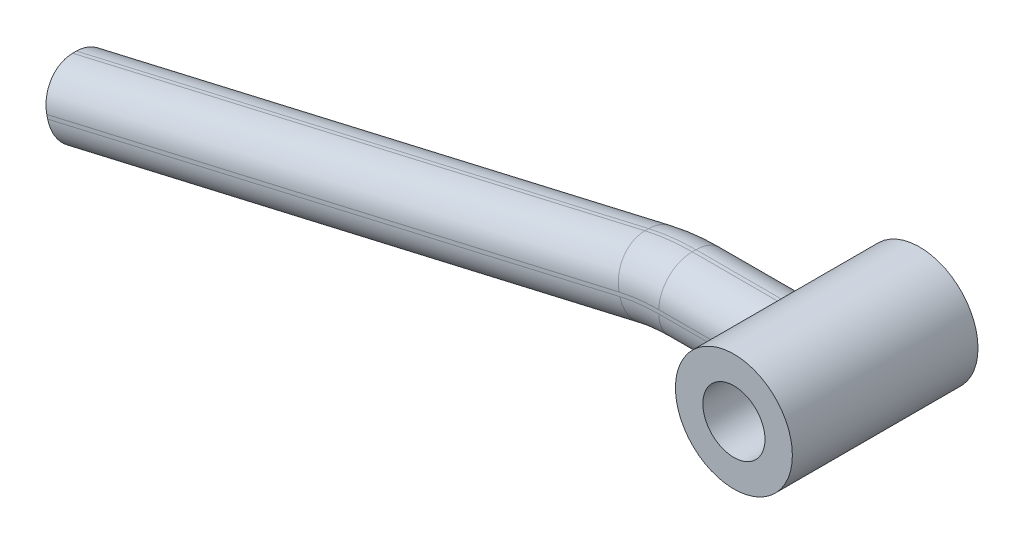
ISO-10303-21;
HEADER;
FILE_DESCRIPTION(('STEP AP214'),'2;1');
FILE_NAME('part.step','',(''),(''),'','','');
FILE_SCHEMA(('AUTOMOTIVE_DESIGN { 1 0 10303 214 1 1 1 1 }'));
ENDSEC;
DATA;
#1=APPLICATION_CONTEXT('core data for automotive mechanical design processes');
#2=APPLICATION_PROTOCOL_DEFINITION('international standard','automotive_design',2000,#1);
#3=PRODUCT_CONTEXT('',#1,'mechanical');
#4=PRODUCT('Part','Part','',(#3));
#5=PRODUCT_RELATED_PRODUCT_CATEGORY('part','',(#4));
#6=PRODUCT_DEFINITION_FORMATION('','',#4);
#7=PRODUCT_DEFINITION_CONTEXT('part definition',#1,'design');
#8=PRODUCT_DEFINITION('design','',#6,#7);
#9=PRODUCT_DEFINITION_SHAPE('','',#8);
#10=(LENGTH_UNIT() NAMED_UNIT(*) SI_UNIT(.MILLI.,.METRE.));
#11=(NAMED_UNIT(*) PLANE_ANGLE_UNIT() SI_UNIT($,.RADIAN.));
#12=(NAMED_UNIT(*) SI_UNIT($,.STERADIAN.) SOLID_ANGLE_UNIT());
#13=UNCERTAINTY_MEASURE_WITH_UNIT(LENGTH_MEASURE(1.E-05),#10,'distance_accuracy_value','');
#14=(GEOMETRIC_REPRESENTATION_CONTEXT(3) GLOBAL_UNCERTAINTY_ASSIGNED_CONTEXT((#13)) GLOBAL_UNIT_ASSIGNED_CONTEXT((#10,
#11,#12)) REPRESENTATION_CONTEXT('',''));
#15=CARTESIAN_POINT('',(0.,0.,0.));
#16=DIRECTION('',(0.,0.,1.));
#17=DIRECTION('',(1.,0.,0.));
#18=AXIS2_PLACEMENT_3D('',#15,#16,#17);
#19=CARTESIAN_POINT('',(0.,0.,6.35));
#20=DIRECTION('',(0.,0.,-1.));
#21=DIRECTION('',(-1.,0.,0.));
#22=AXIS2_PLACEMENT_3D('',#19,#20,#21);
#23=CYLINDRICAL_SURFACE('',#22,4.0005);
#24=DIRECTION('',(0.,0.,-1.));
#25=VECTOR('',#24,1.);
#26=CARTESIAN_POINT('',(-3.19083550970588,2.413,6.35));
#27=LINE('',#26,#25);
#28=CARTESIAN_POINT('',(-3.19083550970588,2.413,0.127));
#29=VERTEX_POINT('',#28);
#30=CARTESIAN_POINT('',(-3.19083550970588,2.413,-0.127));
#31=VERTEX_POINT('',#30);
#32=EDGE_CURVE('E296',#29,#31,#27,.T.);
#33=ORIENTED_EDGE('',*,*,#32,.F.);
#34=CARTESIAN_POINT('',(-3.19083550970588,2.413,0.127));
#35=CARTESIAN_POINT('',(-3.19081169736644,2.41301290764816,0.184622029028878));
#36=CARTESIAN_POINT('',(-3.19248244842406,2.41082185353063,0.242229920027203));
#37=CARTESIAN_POINT('',(-3.19903175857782,2.40213431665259,0.356882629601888));
#38=CARTESIAN_POINT('',(-3.20390722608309,2.39564198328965,0.413927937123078));
#39=CARTESIAN_POINT('',(-3.21663369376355,2.37852343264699,0.52657680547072));
#40=CARTESIAN_POINT('',(-3.22446034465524,2.36793102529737,0.582188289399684));
#41=CARTESIAN_POINT('',(-3.24277881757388,2.3427821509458,0.692052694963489));
#42=CARTESIAN_POINT('',(-3.25327116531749,2.32822490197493,0.746305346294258));
#43=CARTESIAN_POINT('',(-3.28812294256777,2.27900507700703,0.906132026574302));
#44=CARTESIAN_POINT('',(-3.31591982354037,2.23871513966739,1.00928105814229));
#45=CARTESIAN_POINT('',(-3.37755864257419,2.14458806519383,1.20738021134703));
#46=CARTESIAN_POINT('',(-3.41141424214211,2.09072019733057,1.30231106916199));
#47=CARTESIAN_POINT('',(-3.48639881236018,1.96344375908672,1.49375654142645));
#48=CARTESIAN_POINT('',(-3.5279122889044,1.88846020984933,1.58907542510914));
#49=CARTESIAN_POINT('',(-3.61094457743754,1.72439512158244,1.76674256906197));
#50=CARTESIAN_POINT('',(-3.65246338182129,1.63530659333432,1.84908435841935));
#51=CARTESIAN_POINT('',(-3.73690768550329,1.43281155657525,2.00826604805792));
#52=CARTESIAN_POINT('',(-3.77940820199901,1.31777119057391,2.08327206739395));
#53=CARTESIAN_POINT('',(-3.85577043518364,1.07389111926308,2.21221085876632));
#54=CARTESIAN_POINT('',(-3.88964984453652,0.945080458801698,2.26618691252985));
#55=CARTESIAN_POINT('',(-3.92864557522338,0.756887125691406,2.32525459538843));
#56=CARTESIAN_POINT('',(-3.93891512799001,0.701553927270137,2.34036781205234));
#57=CARTESIAN_POINT('',(-3.95722612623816,0.589551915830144,2.36645101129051));
#58=CARTESIAN_POINT('',(-3.96526811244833,0.532883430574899,2.37742199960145));
#59=CARTESIAN_POINT('',(-3.97898979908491,0.418309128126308,2.39510725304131));
#60=CARTESIAN_POINT('',(-3.98465743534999,0.360398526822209,2.40179986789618));
#61=CARTESIAN_POINT('',(-3.9934809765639,0.244009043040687,2.41075237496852));
#62=CARTESIAN_POINT('',(-3.99663525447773,0.185529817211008,2.41300939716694));
#63=CARTESIAN_POINT('',(-3.99848361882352,0.126999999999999,2.413));
#64=B_SPLINE_CURVE_WITH_KNOTS('',3,(#34,#35,#36,#37,#38,#39,#40,#41,#42,#43,#44,#45,#46,#47,#48,
#49,#50,#51,#52,#53,#54,#55,#56,#57,#58,#59,#60,#61,#62,#63),.UNSPECIFIED.,.F.,.F.,(4,2,2,2,2,2,
2,2,2,2,2,2,2,2,4),(0.,0.172777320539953,0.345388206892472,0.516605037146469,0.687855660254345,
1.02882778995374,1.37057867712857,1.75364117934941,2.13689409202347,2.56595400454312,
2.99412614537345,3.16878253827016,3.34339649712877,3.51888722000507,3.6944914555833),.UNSPECIFIED.);
#65=CARTESIAN_POINT('',(-3.99848361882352,0.126999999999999,2.413));
#66=VERTEX_POINT('',#65);
#67=EDGE_CURVE('E11',#29,#66,#64,.T.);
#68=ORIENTED_EDGE('',*,*,#67,.T.);
#69=CARTESIAN_POINT('',(0.,0.,2.413));
#70=DIRECTION('',(0.,0.,1.));
#71=DIRECTION('',(1.,0.,0.));
#72=AXIS2_PLACEMENT_3D('',#69,#70,#71);
#73=CIRCLE('',#72,4.0005);
#74=CARTESIAN_POINT('',(-3.99848361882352,-0.127000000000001,2.413));
#75=VERTEX_POINT('',#74);
#76=EDGE_CURVE('E161',#66,#75,#73,.T.);
#77=ORIENTED_EDGE('',*,*,#76,.T.);
#78=CARTESIAN_POINT('',(-3.99848361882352,-0.127000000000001,2.413));
#79=CARTESIAN_POINT('',(-3.99659606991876,-0.186799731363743,2.4130104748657));
#80=CARTESIAN_POINT('',(-3.99334406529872,-0.24654662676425,2.41065390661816));
#81=CARTESIAN_POINT('',(-3.98421628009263,-0.365443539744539,2.40130913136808));
#82=CARTESIAN_POINT('',(-3.97834192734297,-0.424593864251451,2.39432344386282));
#83=CARTESIAN_POINT('',(-3.96411161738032,-0.541549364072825,2.3758736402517));
#84=CARTESIAN_POINT('',(-3.95576951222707,-0.599360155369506,2.36443441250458));
#85=CARTESIAN_POINT('',(-3.9367739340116,-0.713559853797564,2.3372472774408));
#86=CARTESIAN_POINT('',(-3.926120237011,-0.769948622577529,2.32149895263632));
#87=CARTESIAN_POINT('',(-3.89104772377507,-0.936225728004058,2.26813410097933));
#88=CARTESIAN_POINT('',(-3.86347718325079,-1.04354240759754,2.22434630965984));
#89=CARTESIAN_POINT('',(-3.80205621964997,-1.24896686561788,2.12204468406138));
#90=CARTESIAN_POINT('',(-3.76819831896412,-1.34706346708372,2.06351328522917));
#91=CARTESIAN_POINT('',(-3.69377426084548,-1.53998120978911,1.92817862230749));
#92=CARTESIAN_POINT('',(-3.6528884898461,-1.63391768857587,1.85029065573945));
#93=CARTESIAN_POINT('',(-3.56988230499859,-1.80811413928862,1.68084790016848));
#94=CARTESIAN_POINT('',(-3.5277602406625,-1.88835475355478,1.58927410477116));
#95=CARTESIAN_POINT('',(-3.44138645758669,-2.04192246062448,1.38287963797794));
#96=CARTESIAN_POINT('',(-3.39742383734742,-2.1134712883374,1.26660430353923));
#97=CARTESIAN_POINT('',(-3.318465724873,-2.2354168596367,1.02088431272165));
#98=CARTESIAN_POINT('',(-3.28343831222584,-2.28588932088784,0.891488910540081));
#99=CARTESIAN_POINT('',(-3.24563345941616,-2.3388398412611,0.706931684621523));
#100=CARTESIAN_POINT('',(-3.23637857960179,-2.35160355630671,0.655890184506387));
#101=CARTESIAN_POINT('',(-3.22025595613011,-2.37363416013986,0.552686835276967));
#102=CARTESIAN_POINT('',(-3.21338741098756,-2.38290222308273,0.50052536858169));
#103=CARTESIAN_POINT('',(-3.20224302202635,-2.39785997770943,0.395041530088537));
#104=CARTESIAN_POINT('',(-3.1979855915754,-2.40352426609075,0.341713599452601));
#105=CARTESIAN_POINT('',(-3.19227150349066,-2.41110087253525,0.234594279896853));
#106=CARTESIAN_POINT('',(-3.19081745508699,-2.41300969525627,0.180802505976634));
#107=CARTESIAN_POINT('',(-3.19083550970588,-2.413,0.127));
#108=B_SPLINE_CURVE_WITH_KNOTS('',3,(#78,#79,#80,#81,#82,#83,#84,#85,#86,#87,#88,#89,#90,#91,
#92,#93,#94,#95,#96,#97,#98,#99,#100,#101,#102,#103,#104,#105,#106,#107),.UNSPECIFIED.,.F.,.F.,
(4,2,2,2,2,2,2,2,2,2,2,2,2,2,4),(0.,0.179411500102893,0.358725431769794,0.537051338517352,
0.715394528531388,1.07112063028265,1.42727254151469,1.8118189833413,2.19690451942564,
2.62507958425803,3.05170289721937,3.21182695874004,3.37189718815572,3.53308361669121,
3.69441999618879),.UNSPECIFIED.);
#109=CARTESIAN_POINT('',(-3.19083550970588,-2.413,0.127));
#110=VERTEX_POINT('',#109);
#111=EDGE_CURVE('E222',#75,#110,#108,.T.);
#112=ORIENTED_EDGE('',*,*,#111,.T.);
#113=DIRECTION('',(0.,0.,-1.));
#114=VECTOR('',#113,1.);
#115=CARTESIAN_POINT('',(-3.19083550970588,-2.413,6.35));
#116=LINE('',#115,#114);
#117=CARTESIAN_POINT('',(-3.19083550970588,-2.413,-0.127));
#118=VERTEX_POINT('',#117);
#119=EDGE_CURVE('E287',#118,#110,#116,.F.);
#120=ORIENTED_EDGE('',*,*,#119,.F.);
#121=CARTESIAN_POINT('',(-3.19083550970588,-2.413,-0.127));
#122=CARTESIAN_POINT('',(-3.19081169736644,-2.41301290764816,-0.184622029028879));
#123=CARTESIAN_POINT('',(-3.19248244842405,-2.41082185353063,-0.242229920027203));
#124=CARTESIAN_POINT('',(-3.19903175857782,-2.40213431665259,-0.356882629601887));
#125=CARTESIAN_POINT('',(-3.20390722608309,-2.39564198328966,-0.413927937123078));
#126=CARTESIAN_POINT('',(-3.21663369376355,-2.37852343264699,-0.52657680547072));
#127=CARTESIAN_POINT('',(-3.22446034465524,-2.36793102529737,-0.582188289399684));
#128=CARTESIAN_POINT('',(-3.24277881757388,-2.3427821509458,-0.692052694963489));
#129=CARTESIAN_POINT('',(-3.25327116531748,-2.32822490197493,-0.746305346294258));
#130=CARTESIAN_POINT('',(-3.28812294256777,-2.27900507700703,-0.906132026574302));
#131=CARTESIAN_POINT('',(-3.31591982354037,-2.23871513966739,-1.00928105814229));
#132=CARTESIAN_POINT('',(-3.37755864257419,-2.14458806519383,-1.20738021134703));
#133=CARTESIAN_POINT('',(-3.41141424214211,-2.09072019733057,-1.30231106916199));
#134=CARTESIAN_POINT('',(-3.48639881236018,-1.96344375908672,-1.49375654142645));
#135=CARTESIAN_POINT('',(-3.5279122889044,-1.88846020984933,-1.58907542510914));
#136=CARTESIAN_POINT('',(-3.61094457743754,-1.72439512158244,-1.76674256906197));
#137=CARTESIAN_POINT('',(-3.65246338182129,-1.63530659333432,-1.84908435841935));
#138=CARTESIAN_POINT('',(-3.73690768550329,-1.43281155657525,-2.00826604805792));
#139=CARTESIAN_POINT('',(-3.77940820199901,-1.31777119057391,-2.08327206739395));
#140=CARTESIAN_POINT('',(-3.85577043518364,-1.07389111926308,-2.21221085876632));
#141=CARTESIAN_POINT('',(-3.88964984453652,-0.945080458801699,-2.26618691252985));
#142=CARTESIAN_POINT('',(-3.92864557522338,-0.756887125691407,-2.32525459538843));
#143=CARTESIAN_POINT('',(-3.93891512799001,-0.701553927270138,-2.34036781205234));
#144=CARTESIAN_POINT('',(-3.95722612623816,-0.589551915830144,-2.36645101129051));
#145=CARTESIAN_POINT('',(-3.96526811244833,-0.5328834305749,-2.37742199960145));
#146=CARTESIAN_POINT('',(-3.9789897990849,-0.418309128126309,-2.39510725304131));
#147=CARTESIAN_POINT('',(-3.98465743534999,-0.36039852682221,-2.40179986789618));
#148=CARTESIAN_POINT('',(-3.9934809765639,-0.244009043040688,-2.41075237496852));
#149=CARTESIAN_POINT('',(-3.99663525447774,-0.185529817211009,-2.41300939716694));
#150=CARTESIAN_POINT('',(-3.99848361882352,-0.127,-2.413));
#151=B_SPLINE_CURVE_WITH_KNOTS('',3,(#121,#122,#123,#124,#125,#126,#127,#128,#129,#130,#131,
#132,#133,#134,#135,#136,#137,#138,#139,#140,#141,#142,#143,#144,#145,#146,#147,#148,#149,#150),
.UNSPECIFIED.,.F.,.F.,(4,2,2,2,2,2,2,2,2,2,2,2,2,2,4),(0.,0.172777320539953,0.345388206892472,
0.516605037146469,0.687855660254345,1.02882778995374,1.37057867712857,1.75364117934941,
2.13689409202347,2.56595400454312,2.99412614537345,3.16878253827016,3.34339649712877,
3.51888722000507,3.6944914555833),.UNSPECIFIED.);
#152=CARTESIAN_POINT('',(-3.99848361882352,-0.127000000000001,-2.413));
#153=VERTEX_POINT('',#152);
#154=EDGE_CURVE('E216',#118,#153,#151,.T.);
#155=ORIENTED_EDGE('',*,*,#154,.T.);
#156=CARTESIAN_POINT('',(0.,0.,-2.413));
#157=DIRECTION('',(0.,0.,1.));
#158=DIRECTION('',(1.,0.,0.));
#159=AXIS2_PLACEMENT_3D('',#156,#157,#158);
#160=CIRCLE('',#159,4.0005);
#161=CARTESIAN_POINT('',(-3.99848361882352,0.126999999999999,-2.413));
#162=VERTEX_POINT('',#161);
#163=EDGE_CURVE('E283',#162,#153,#160,.T.);
#164=ORIENTED_EDGE('',*,*,#163,.F.);
#165=CARTESIAN_POINT('',(-3.99848361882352,0.126999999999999,-2.413));
#166=CARTESIAN_POINT('',(-3.99659606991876,0.186799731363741,-2.4130104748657));
#167=CARTESIAN_POINT('',(-3.99334406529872,0.246546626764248,-2.41065390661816));
#168=CARTESIAN_POINT('',(-3.98421628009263,0.365443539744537,-2.40130913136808));
#169=CARTESIAN_POINT('',(-3.97834192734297,0.424593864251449,-2.39432344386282));
#170=CARTESIAN_POINT('',(-3.96411161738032,0.541549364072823,-2.3758736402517));
#171=CARTESIAN_POINT('',(-3.95576951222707,0.599360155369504,-2.36443441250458));
#172=CARTESIAN_POINT('',(-3.9367739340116,0.713559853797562,-2.3372472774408));
#173=CARTESIAN_POINT('',(-3.926120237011,0.769948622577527,-2.32149895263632));
#174=CARTESIAN_POINT('',(-3.89104772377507,0.936225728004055,-2.26813410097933));
#175=CARTESIAN_POINT('',(-3.86347718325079,1.04354240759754,-2.22434630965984));
#176=CARTESIAN_POINT('',(-3.80205621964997,1.24896686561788,-2.12204468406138));
#177=CARTESIAN_POINT('',(-3.76819831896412,1.34706346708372,-2.06351328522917));
#178=CARTESIAN_POINT('',(-3.69377426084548,1.53998120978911,-1.92817862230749));
#179=CARTESIAN_POINT('',(-3.6528884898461,1.63391768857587,-1.85029065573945));
#180=CARTESIAN_POINT('',(-3.56988230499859,1.80811413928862,-1.68084790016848));
#181=CARTESIAN_POINT('',(-3.5277602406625,1.88835475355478,-1.58927410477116));
#182=CARTESIAN_POINT('',(-3.4413864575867,2.04192246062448,-1.38287963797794));
#183=CARTESIAN_POINT('',(-3.39742383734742,2.11347128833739,-1.26660430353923));
#184=CARTESIAN_POINT('',(-3.318465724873,2.2354168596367,-1.02088431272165));
#185=CARTESIAN_POINT('',(-3.28343831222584,2.28588932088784,-0.891488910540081));
#186=CARTESIAN_POINT('',(-3.24563345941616,2.33883984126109,-0.706931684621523));
#187=CARTESIAN_POINT('',(-3.23637857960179,2.35160355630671,-0.655890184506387));
#188=CARTESIAN_POINT('',(-3.22025595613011,2.37363416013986,-0.552686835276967));
#189=CARTESIAN_POINT('',(-3.21338741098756,2.38290222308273,-0.50052536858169));
#190=CARTESIAN_POINT('',(-3.20224302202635,2.39785997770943,-0.395041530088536));
#191=CARTESIAN_POINT('',(-3.1979855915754,2.40352426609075,-0.3417135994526));
#192=CARTESIAN_POINT('',(-3.19227150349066,2.41110087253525,-0.234594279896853));
#193=CARTESIAN_POINT('',(-3.190817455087,2.41300969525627,-0.180802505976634));
#194=CARTESIAN_POINT('',(-3.19083550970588,2.413,-0.127));
#195=B_SPLINE_CURVE_WITH_KNOTS('',3,(#165,#166,#167,#168,#169,#170,#171,#172,#173,#174,#175,
#176,#177,#178,#179,#180,#181,#182,#183,#184,#185,#186,#187,#188,#189,#190,#191,#192,#193,#194),
.UNSPECIFIED.,.F.,.F.,(4,2,2,2,2,2,2,2,2,2,2,2,2,2,4),(0.,0.179411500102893,0.358725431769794,
0.537051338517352,0.715394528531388,1.07112063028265,1.42727254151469,1.8118189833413,
2.19690451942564,2.62507958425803,3.05170289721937,3.21182695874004,3.37189718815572,
3.53308361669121,3.69441999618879),.UNSPECIFIED.);
#196=EDGE_CURVE('E42',#162,#31,#195,.T.);
#197=ORIENTED_EDGE('',*,*,#196,.T.);
#198=EDGE_LOOP('',(#33,#68,#77,#112,#120,#155,#164,#197));
#199=FACE_BOUND('',#198,.T.);
#200=CARTESIAN_POINT('',(0.,0.,6.35));
#201=DIRECTION('',(0.,0.,1.));
#202=DIRECTION('',(1.,0.,0.));
#203=AXIS2_PLACEMENT_3D('',#200,#201,#202);
#204=CIRCLE('',#203,4.0005);
#205=CARTESIAN_POINT('',(4.0005,0.,6.35));
#206=VERTEX_POINT('',#205);
#207=EDGE_CURVE('E281',#206,#206,#204,.T.);
#208=ORIENTED_EDGE('',*,*,#207,.F.);
#209=EDGE_LOOP('',(#208));
#210=FACE_BOUND('',#209,.T.);
#211=CARTESIAN_POINT('',(0.,0.,-6.35));
#212=DIRECTION('',(0.,0.,1.));
#213=DIRECTION('',(1.,0.,0.));
#214=AXIS2_PLACEMENT_3D('',#211,#212,#213);
#215=CIRCLE('',#214,4.0005);
#216=CARTESIAN_POINT('',(4.0005,0.,-6.35));
#217=VERTEX_POINT('',#216);
#218=EDGE_CURVE('E284',#217,#217,#215,.T.);
#219=ORIENTED_EDGE('',*,*,#218,.T.);
#220=EDGE_LOOP('',(#219));
#221=FACE_BOUND('',#220,.T.);
#222=ADVANCED_FACE('F30',(#199,#210,#221),#23,.T.);
#223=CARTESIAN_POINT('',(0.,0.,6.35));
#224=DIRECTION('',(0.,0.,1.));
#225=DIRECTION('',(1.,0.,0.));
#226=AXIS2_PLACEMENT_3D('',#223,#224,#225);
#227=PLANE('',#226);
#228=CARTESIAN_POINT('',(0.,0.,6.35));
#229=DIRECTION('',(0.,0.,1.));
#230=DIRECTION('',(1.,0.,0.));
#231=AXIS2_PLACEMENT_3D('',#228,#229,#230);
#232=CIRCLE('',#231,2.12601242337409);
#233=CARTESIAN_POINT('',(2.12601242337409,0.,6.35));
#234=VERTEX_POINT('',#233);
#235=EDGE_CURVE('E278',#234,#234,#232,.T.);
#236=ORIENTED_EDGE('',*,*,#235,.F.);
#237=EDGE_LOOP('',(#236));
#238=FACE_BOUND('',#237,.T.);
#239=ORIENTED_EDGE('',*,*,#207,.T.);
#240=EDGE_LOOP('',(#239));
#241=FACE_BOUND('',#240,.T.);
#242=ADVANCED_FACE('F268',(#238,#241),#227,.T.);
#243=CARTESIAN_POINT('',(0.,0.,-6.35));
#244=DIRECTION('',(0.,0.,1.));
#245=DIRECTION('',(1.,0.,0.));
#246=AXIS2_PLACEMENT_3D('',#243,#244,#245);
#247=PLANE('',#246);
#248=CARTESIAN_POINT('',(0.,0.,-6.35));
#249=DIRECTION('',(0.,0.,1.));
#250=DIRECTION('',(1.,0.,0.));
#251=AXIS2_PLACEMENT_3D('',#248,#249,#250);
#252=CIRCLE('',#251,2.12601242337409);
#253=CARTESIAN_POINT('',(2.12601242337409,0.,-6.35));
#254=VERTEX_POINT('',#253);
#255=EDGE_CURVE('E415',#254,#254,#252,.T.);
#256=ORIENTED_EDGE('',*,*,#255,.T.);
#257=EDGE_LOOP('',(#256));
#258=FACE_BOUND('',#257,.T.);
#259=ORIENTED_EDGE('',*,*,#218,.F.);
#260=EDGE_LOOP('',(#259));
#261=FACE_BOUND('',#260,.T.);
#262=ADVANCED_FACE('F266',(#258,#261),#247,.F.);
#263=CARTESIAN_POINT('',(0.,2.413,2.413));
#264=DIRECTION('',(0.,-1.,0.));
#265=DIRECTION('',(1.,0.,0.));
#266=AXIS2_PLACEMENT_3D('',#263,#264,#265);
#267=PLANE('',#266);
#268=ORIENTED_EDGE('',*,*,#32,.T.);
#269=DIRECTION('',(-1.,0.,0.));
#270=VECTOR('',#269,1.);
#271=CARTESIAN_POINT('',(0.,2.413,-0.127));
#272=LINE('',#271,#270);
#273=CARTESIAN_POINT('',(-9.07272461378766,2.413,-0.127));
#274=VERTEX_POINT('',#273);
#275=EDGE_CURVE('E214',#31,#274,#272,.T.);
#276=ORIENTED_EDGE('',*,*,#275,.T.);
#277=DIRECTION('',(0.,0.,-1.));
#278=VECTOR('',#277,1.);
#279=CARTESIAN_POINT('',(-9.07272461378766,2.413,2.413));
#280=LINE('',#279,#278);
#281=CARTESIAN_POINT('',(-9.07272461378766,2.413,0.127));
#282=VERTEX_POINT('',#281);
#283=EDGE_CURVE('E290',#282,#274,#280,.T.);
#284=ORIENTED_EDGE('',*,*,#283,.F.);
#285=DIRECTION('',(-1.,0.,0.));
#286=VECTOR('',#285,1.);
#287=CARTESIAN_POINT('',(-3.19083550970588,2.413,0.127));
#288=LINE('',#287,#286);
#289=EDGE_CURVE('E55',#282,#29,#288,.F.);
#290=ORIENTED_EDGE('',*,*,#289,.T.);
#291=EDGE_LOOP('',(#268,#276,#284,#290));
#292=FACE_BOUND('',#291,.T.);
#293=ADVANCED_FACE('F248',(#292),#267,.F.);
#294=CARTESIAN_POINT('',(0.,-2.413,2.413));
#295=DIRECTION('',(0.,1.,0.));
#296=DIRECTION('',(-1.,0.,0.));
#297=AXIS2_PLACEMENT_3D('',#294,#295,#296);
#298=PLANE('',#297);
#299=DIRECTION('',(0.,0.,-1.));
#300=VECTOR('',#299,1.);
#301=CARTESIAN_POINT('',(-9.07272461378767,-2.413,2.413));
#302=LINE('',#301,#300);
#303=CARTESIAN_POINT('',(-9.07272461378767,-2.413,0.127));
#304=VERTEX_POINT('',#303);
#305=CARTESIAN_POINT('',(-9.07272461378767,-2.413,-0.127));
#306=VERTEX_POINT('',#305);
#307=EDGE_CURVE('E386',#304,#306,#302,.T.);
#308=ORIENTED_EDGE('',*,*,#307,.T.);
#309=DIRECTION('',(1.,0.,0.));
#310=VECTOR('',#309,1.);
#311=CARTESIAN_POINT('',(0.,-2.413,-0.127));
#312=LINE('',#311,#310);
#313=EDGE_CURVE('E189',#306,#118,#312,.T.);
#314=ORIENTED_EDGE('',*,*,#313,.T.);
#315=ORIENTED_EDGE('',*,*,#119,.T.);
#316=DIRECTION('',(1.,0.,0.));
#317=VECTOR('',#316,1.);
#318=CARTESIAN_POINT('',(-9.07272461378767,-2.413,0.127));
#319=LINE('',#318,#317);
#320=EDGE_CURVE('E187',#110,#304,#319,.F.);
#321=ORIENTED_EDGE('',*,*,#320,.T.);
#322=EDGE_LOOP('',(#308,#314,#315,#321));
#323=FACE_BOUND('',#322,.T.);
#324=ADVANCED_FACE('F244',(#323),#298,.F.);
#325=CARTESIAN_POINT('',(-9.07272461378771,-11.938,2.413));
#326=DIRECTION('',(0.,0.,1.));
#327=DIRECTION('',(1.,0.,0.));
#328=AXIS2_PLACEMENT_3D('',#325,#326,#327);
#329=PLANE('',#328);
#330=CARTESIAN_POINT('',(-9.07272461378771,-11.938,2.413));
#331=DIRECTION('',(0.,0.,1.));
#332=DIRECTION('',(1.,0.,0.));
#333=AXIS2_PLACEMENT_3D('',#330,#331,#332);
#334=CIRCLE('',#333,11.811);
#335=CARTESIAN_POINT('',(-11.7344844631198,-0.430838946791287,2.413));
#336=VERTEX_POINT('',#335);
#337=CARTESIAN_POINT('',(-9.07272461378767,-0.127000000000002,2.413));
#338=VERTEX_POINT('',#337);
#339=EDGE_CURVE('E199',#336,#338,#334,.F.);
#340=ORIENTED_EDGE('',*,*,#339,.T.);
#341=DIRECTION('',(1.,0.,0.));
#342=VECTOR('',#341,1.);
#343=CARTESIAN_POINT('',(-3.19083550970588,-0.127000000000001,2.413));
#344=LINE('',#343,#342);
#345=EDGE_CURVE('E201',#338,#75,#344,.T.);
#346=ORIENTED_EDGE('',*,*,#345,.T.);
#347=ORIENTED_EDGE('',*,*,#76,.F.);
#348=DIRECTION('',(-1.,0.,0.));
#349=VECTOR('',#348,1.);
#350=CARTESIAN_POINT('',(-9.07272461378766,0.126999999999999,2.413));
#351=LINE('',#350,#349);
#352=CARTESIAN_POINT('',(-9.07272461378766,0.126999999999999,2.413));
#353=VERTEX_POINT('',#352);
#354=EDGE_CURVE('E195',#66,#353,#351,.T.);
#355=ORIENTED_EDGE('',*,*,#354,.T.);
#356=CARTESIAN_POINT('',(-9.07272461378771,-11.938,2.413));
#357=DIRECTION('',(0.,0.,1.));
#358=DIRECTION('',(1.,0.,0.));
#359=AXIS2_PLACEMENT_3D('',#356,#357,#358);
#360=CIRCLE('',#359,12.065);
#361=CARTESIAN_POINT('',(-11.7917266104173,-0.183373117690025,2.413));
#362=VERTEX_POINT('',#361);
#363=EDGE_CURVE('E193',#353,#362,#360,.T.);
#364=ORIENTED_EDGE('',*,*,#363,.T.);
#365=DIRECTION('',(-0.974274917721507,-0.225362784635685,0.));
#366=VECTOR('',#365,1.);
#367=CARTESIAN_POINT('',(-50.9456187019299,-9.24019064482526,2.413));
#368=LINE('',#367,#366);
#369=CARTESIAN_POINT('',(-50.9456187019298,-9.24019064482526,2.413));
#370=VERTEX_POINT('',#369);
#371=EDGE_CURVE('E191',#362,#370,#368,.T.);
#372=ORIENTED_EDGE('',*,*,#371,.T.);
#373=DIRECTION('',(0.225362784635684,-0.974274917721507,0.));
#374=VECTOR('',#373,1.);
#375=CARTESIAN_POINT('',(-51.460798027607,-7.01299818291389,2.413));
#376=LINE('',#375,#374);
#377=CARTESIAN_POINT('',(-50.8883765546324,-9.48765647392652,2.413));
#378=VERTEX_POINT('',#377);
#379=EDGE_CURVE('E315',#370,#378,#376,.T.);
#380=ORIENTED_EDGE('',*,*,#379,.T.);
#381=DIRECTION('',(0.974274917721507,0.225362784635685,0.));
#382=VECTOR('',#381,1.);
#383=CARTESIAN_POINT('',(-11.7344844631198,-0.430838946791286,2.413));
#384=LINE('',#383,#382);
#385=EDGE_CURVE('E175',#378,#336,#384,.T.);
#386=ORIENTED_EDGE('',*,*,#385,.T.);
#387=EDGE_LOOP('',(#340,#346,#347,#355,#364,#372,#380,#386));
#388=FACE_BOUND('',#387,.T.);
#389=ADVANCED_FACE('F240',(#388),#329,.T.);
#390=CARTESIAN_POINT('',(-9.07272461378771,-11.938,-2.413));
#391=DIRECTION('',(0.,0.,1.));
#392=DIRECTION('',(1.,0.,0.));
#393=AXIS2_PLACEMENT_3D('',#390,#391,#392);
#394=PLANE('',#393);
#395=CARTESIAN_POINT('',(-9.07272461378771,-11.938,-2.413));
#396=DIRECTION('',(0.,0.,1.));
#397=DIRECTION('',(1.,0.,0.));
#398=AXIS2_PLACEMENT_3D('',#395,#396,#397);
#399=CIRCLE('',#398,11.811);
#400=CARTESIAN_POINT('',(-9.07272461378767,-0.127000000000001,-2.413));
#401=VERTEX_POINT('',#400);
#402=CARTESIAN_POINT('',(-11.7344844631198,-0.430838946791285,-2.413));
#403=VERTEX_POINT('',#402);
#404=EDGE_CURVE('E309',#401,#403,#399,.T.);
#405=ORIENTED_EDGE('',*,*,#404,.T.);
#406=DIRECTION('',(0.974274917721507,0.225362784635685,0.));
#407=VECTOR('',#406,1.);
#408=CARTESIAN_POINT('',(-11.7344844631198,-0.430838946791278,-2.413));
#409=LINE('',#408,#407);
#410=CARTESIAN_POINT('',(-50.8883765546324,-9.48765647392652,-2.413));
#411=VERTEX_POINT('',#410);
#412=EDGE_CURVE('E311',#403,#411,#409,.F.);
#413=ORIENTED_EDGE('',*,*,#412,.T.);
#414=DIRECTION('',(0.225362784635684,-0.974274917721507,0.));
#415=VECTOR('',#414,1.);
#416=CARTESIAN_POINT('',(-51.460798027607,-7.01299818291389,-2.413));
#417=LINE('',#416,#415);
#418=CARTESIAN_POINT('',(-50.9456187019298,-9.24019064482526,-2.413));
#419=VERTEX_POINT('',#418);
#420=EDGE_CURVE('E403',#419,#411,#417,.T.);
#421=ORIENTED_EDGE('',*,*,#420,.F.);
#422=DIRECTION('',(-0.974274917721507,-0.225362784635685,0.));
#423=VECTOR('',#422,1.);
#424=CARTESIAN_POINT('',(-11.7917266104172,-0.183373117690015,-2.413));
#425=LINE('',#424,#423);
#426=CARTESIAN_POINT('',(-11.7917266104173,-0.183373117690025,-2.413));
#427=VERTEX_POINT('',#426);
#428=EDGE_CURVE('E305',#419,#427,#425,.F.);
#429=ORIENTED_EDGE('',*,*,#428,.T.);
#430=CARTESIAN_POINT('',(-9.07272461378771,-11.938,-2.413));
#431=DIRECTION('',(0.,0.,1.));
#432=DIRECTION('',(1.,0.,0.));
#433=AXIS2_PLACEMENT_3D('',#430,#431,#432);
#434=CIRCLE('',#433,12.065);
#435=CARTESIAN_POINT('',(-9.07272461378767,0.126999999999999,-2.413));
#436=VERTEX_POINT('',#435);
#437=EDGE_CURVE('E303',#427,#436,#434,.F.);
#438=ORIENTED_EDGE('',*,*,#437,.T.);
#439=DIRECTION('',(-1.,0.,0.));
#440=VECTOR('',#439,1.);
#441=CARTESIAN_POINT('',(-9.07272461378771,0.126999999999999,-2.413));
#442=LINE('',#441,#440);
#443=EDGE_CURVE('E301',#436,#162,#442,.F.);
#444=ORIENTED_EDGE('',*,*,#443,.T.);
#445=ORIENTED_EDGE('',*,*,#163,.T.);
#446=DIRECTION('',(1.,0.,0.));
#447=VECTOR('',#446,1.);
#448=CARTESIAN_POINT('',(-9.07272461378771,-0.127000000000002,-2.413));
#449=LINE('',#448,#447);
#450=EDGE_CURVE('E307',#153,#401,#449,.F.);
#451=ORIENTED_EDGE('',*,*,#450,.T.);
#452=EDGE_LOOP('',(#405,#413,#421,#429,#438,#444,#445,#451));
#453=FACE_BOUND('',#452,.T.);
#454=ADVANCED_FACE('F236',(#453),#394,.F.);
#455=CARTESIAN_POINT('',(-9.07272461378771,-11.938,2.413));
#456=DIRECTION('',(0.,0.,-1.));
#457=DIRECTION('',(-1.,0.,0.));
#458=AXIS2_PLACEMENT_3D('',#455,#456,#457);
#459=CYLINDRICAL_SURFACE('',#458,14.351);
#460=ORIENTED_EDGE('',*,*,#283,.T.);
#461=CARTESIAN_POINT('',(-9.07272461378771,-11.938,-0.127));
#462=DIRECTION('',(0.,0.,1.));
#463=DIRECTION('',(1.,0.,0.));
#464=AXIS2_PLACEMENT_3D('',#461,#462,#463);
#465=CIRCLE('',#464,14.351);
#466=CARTESIAN_POINT('',(-12.3069059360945,2.04381934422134,-0.127));
#467=VERTEX_POINT('',#466);
#468=EDGE_CURVE('E211',#274,#467,#465,.T.);
#469=ORIENTED_EDGE('',*,*,#468,.T.);
#470=DIRECTION('',(0.,0.,-1.));
#471=VECTOR('',#470,1.);
#472=CARTESIAN_POINT('',(-12.3069059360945,2.04381934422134,2.413));
#473=LINE('',#472,#471);
#474=CARTESIAN_POINT('',(-12.3069059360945,2.04381934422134,0.127));
#475=VERTEX_POINT('',#474);
#476=EDGE_CURVE('E322',#475,#467,#473,.T.);
#477=ORIENTED_EDGE('',*,*,#476,.F.);
#478=CARTESIAN_POINT('',(-9.07272461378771,-11.938,0.127));
#479=DIRECTION('',(0.,0.,1.));
#480=DIRECTION('',(1.,0.,0.));
#481=AXIS2_PLACEMENT_3D('',#478,#479,#480);
#482=CIRCLE('',#481,14.351);
#483=EDGE_CURVE('E209',#475,#282,#482,.F.);
#484=ORIENTED_EDGE('',*,*,#483,.T.);
#485=EDGE_LOOP('',(#460,#469,#477,#484));
#486=FACE_BOUND('',#485,.T.);
#487=ADVANCED_FACE('F239',(#486),#459,.T.);
#488=CARTESIAN_POINT('',(-12.3069059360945,2.04381934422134,2.413));
#489=DIRECTION('',(0.225362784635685,-0.974274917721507,0.));
#490=DIRECTION('',(0.974274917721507,0.225362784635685,0.));
#491=AXIS2_PLACEMENT_3D('',#488,#489,#490);
#492=PLANE('',#491);
#493=ORIENTED_EDGE('',*,*,#476,.T.);
#494=DIRECTION('',(-0.974274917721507,-0.225362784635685,0.));
#495=VECTOR('',#494,1.);
#496=CARTESIAN_POINT('',(-12.3069059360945,2.04381934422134,-0.127));
#497=LINE('',#496,#495);
#498=CARTESIAN_POINT('',(-51.460798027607,-7.01299818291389,-0.127));
#499=VERTEX_POINT('',#498);
#500=EDGE_CURVE('E206',#467,#499,#497,.T.);
#501=ORIENTED_EDGE('',*,*,#500,.T.);
#502=DIRECTION('',(0.,0.,-1.));
#503=VECTOR('',#502,1.);
#504=CARTESIAN_POINT('',(-51.460798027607,-7.01299818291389,2.413));
#505=LINE('',#504,#503);
#506=CARTESIAN_POINT('',(-51.460798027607,-7.01299818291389,0.127));
#507=VERTEX_POINT('',#506);
#508=EDGE_CURVE('E171',#507,#499,#505,.T.);
#509=ORIENTED_EDGE('',*,*,#508,.F.);
#510=DIRECTION('',(-0.974274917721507,-0.225362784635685,0.));
#511=VECTOR('',#510,1.);
#512=CARTESIAN_POINT('',(-12.3069059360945,2.04381934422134,0.127));
#513=LINE('',#512,#511);
#514=EDGE_CURVE('E204',#507,#475,#513,.F.);
#515=ORIENTED_EDGE('',*,*,#514,.T.);
#516=EDGE_LOOP('',(#493,#501,#509,#515));
#517=FACE_BOUND('',#516,.T.);
#518=ADVANCED_FACE('F257',(#517),#492,.F.);
#519=CARTESIAN_POINT('',(-51.460798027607,-7.01299818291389,2.413));
#520=DIRECTION('',(0.974274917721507,0.225362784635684,0.));
#521=DIRECTION('',(-0.225362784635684,0.974274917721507,0.));
#522=AXIS2_PLACEMENT_3D('',#519,#520,#521);
#523=PLANE('',#522);
#524=ORIENTED_EDGE('',*,*,#420,.T.);
#525=CARTESIAN_POINT('',(-50.8883765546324,-9.48765647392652,-0.127));
#526=DIRECTION('',(0.974274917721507,0.225362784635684,0.));
#527=DIRECTION('',(-0.225362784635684,0.974274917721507,0.));
#528=AXIS2_PLACEMENT_3D('',#525,#526,#527);
#529=CIRCLE('',#528,2.286);
#530=CARTESIAN_POINT('',(-50.3731972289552,-11.7148489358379,-0.127));
#531=VERTEX_POINT('',#530);
#532=EDGE_CURVE('E170',#411,#531,#529,.F.);
#533=ORIENTED_EDGE('',*,*,#532,.T.);
#534=DIRECTION('',(0.,0.,-1.));
#535=VECTOR('',#534,1.);
#536=CARTESIAN_POINT('',(-50.3731972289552,-11.7148489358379,2.413));
#537=LINE('',#536,#535);
#538=CARTESIAN_POINT('',(-50.3731972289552,-11.7148489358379,0.127));
#539=VERTEX_POINT('',#538);
#540=EDGE_CURVE('E152',#539,#531,#537,.T.);
#541=ORIENTED_EDGE('',*,*,#540,.F.);
#542=CARTESIAN_POINT('',(-50.8883765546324,-9.48765647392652,0.127));
#543=DIRECTION('',(0.974274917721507,0.225362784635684,0.));
#544=DIRECTION('',(-0.225362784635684,0.974274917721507,0.));
#545=AXIS2_PLACEMENT_3D('',#542,#543,#544);
#546=CIRCLE('',#545,2.286);
#547=EDGE_CURVE('E167',#539,#378,#546,.F.);
#548=ORIENTED_EDGE('',*,*,#547,.T.);
#549=ORIENTED_EDGE('',*,*,#379,.F.);
#550=CARTESIAN_POINT('',(-50.9456187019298,-9.24019064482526,0.127));
#551=DIRECTION('',(0.974274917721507,0.225362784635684,0.));
#552=DIRECTION('',(-0.225362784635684,0.974274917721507,0.));
#553=AXIS2_PLACEMENT_3D('',#550,#551,#552);
#554=CIRCLE('',#553,2.286);
#555=EDGE_CURVE('E180',#370,#507,#554,.F.);
#556=ORIENTED_EDGE('',*,*,#555,.T.);
#557=ORIENTED_EDGE('',*,*,#508,.T.);
#558=CARTESIAN_POINT('',(-50.9456187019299,-9.24019064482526,-0.127));
#559=DIRECTION('',(0.974274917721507,0.225362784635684,0.));
#560=DIRECTION('',(-0.225362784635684,0.974274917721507,0.));
#561=AXIS2_PLACEMENT_3D('',#558,#559,#560);
#562=CIRCLE('',#561,2.286);
#563=EDGE_CURVE('E176',#499,#419,#562,.F.);
#564=ORIENTED_EDGE('',*,*,#563,.T.);
#565=EDGE_LOOP('',(#524,#533,#541,#548,#549,#556,#557,#564));
#566=FACE_BOUND('',#565,.T.);
#567=ADVANCED_FACE('F165',(#566),#523,.F.);
#568=CARTESIAN_POINT('',(-11.2193051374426,-2.65803140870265,2.413));
#569=DIRECTION('',(-0.225362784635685,0.974274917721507,0.));
#570=DIRECTION('',(-0.974274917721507,-0.225362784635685,0.));
#571=AXIS2_PLACEMENT_3D('',#568,#569,#570);
#572=PLANE('',#571);
#573=ORIENTED_EDGE('',*,*,#540,.T.);
#574=DIRECTION('',(0.974274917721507,0.225362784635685,0.));
#575=VECTOR('',#574,1.);
#576=CARTESIAN_POINT('',(-11.2193051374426,-2.65803140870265,-0.127));
#577=LINE('',#576,#575);
#578=CARTESIAN_POINT('',(-11.2193051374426,-2.65803140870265,-0.127));
#579=VERTEX_POINT('',#578);
#580=EDGE_CURVE('E160',#531,#579,#577,.T.);
#581=ORIENTED_EDGE('',*,*,#580,.T.);
#582=DIRECTION('',(0.,0.,-1.));
#583=VECTOR('',#582,1.);
#584=CARTESIAN_POINT('',(-11.2193051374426,-2.65803140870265,2.413));
#585=LINE('',#584,#583);
#586=CARTESIAN_POINT('',(-11.2193051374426,-2.65803140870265,0.127));
#587=VERTEX_POINT('',#586);
#588=EDGE_CURVE('E155',#587,#579,#585,.T.);
#589=ORIENTED_EDGE('',*,*,#588,.F.);
#590=DIRECTION('',(0.974274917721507,0.225362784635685,0.));
#591=VECTOR('',#590,1.);
#592=CARTESIAN_POINT('',(-50.3731972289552,-11.7148489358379,0.127));
#593=LINE('',#592,#591);
#594=EDGE_CURVE('E148',#587,#539,#593,.F.);
#595=ORIENTED_EDGE('',*,*,#594,.T.);
#596=EDGE_LOOP('',(#573,#581,#589,#595));
#597=FACE_BOUND('',#596,.T.);
#598=ADVANCED_FACE('F150',(#597),#572,.F.);
#599=CARTESIAN_POINT('',(-9.07272461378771,-11.938,2.413));
#600=DIRECTION('',(0.,0.,-1.));
#601=DIRECTION('',(-1.,0.,0.));
#602=AXIS2_PLACEMENT_3D('',#599,#600,#601);
#603=CYLINDRICAL_SURFACE('',#602,9.525);
#604=ORIENTED_EDGE('',*,*,#588,.T.);
#605=CARTESIAN_POINT('',(-9.07272461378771,-11.938,-0.127));
#606=DIRECTION('',(0.,0.,1.));
#607=DIRECTION('',(1.,0.,0.));
#608=AXIS2_PLACEMENT_3D('',#605,#606,#607);
#609=CIRCLE('',#608,9.525);
#610=EDGE_CURVE('E185',#579,#306,#609,.F.);
#611=ORIENTED_EDGE('',*,*,#610,.T.);
#612=ORIENTED_EDGE('',*,*,#307,.F.);
#613=CARTESIAN_POINT('',(-9.07272461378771,-11.938,0.127));
#614=DIRECTION('',(0.,0.,1.));
#615=DIRECTION('',(1.,0.,0.));
#616=AXIS2_PLACEMENT_3D('',#613,#614,#615);
#617=CIRCLE('',#616,9.525);
#618=EDGE_CURVE('E178',#304,#587,#617,.T.);
#619=ORIENTED_EDGE('',*,*,#618,.T.);
#620=EDGE_LOOP('',(#604,#611,#612,#619));
#621=FACE_BOUND('',#620,.T.);
#622=ADVANCED_FACE('F233',(#621),#603,.F.);
#623=CARTESIAN_POINT('',(0.,-0.127,-0.127));
#624=DIRECTION('',(1.,0.,0.));
#625=DIRECTION('',(0.,1.,0.));
#626=AXIS2_PLACEMENT_3D('',#623,#624,#625);
#627=CYLINDRICAL_SURFACE('',#626,2.286);
#628=ORIENTED_EDGE('',*,*,#154,.F.);
#629=ORIENTED_EDGE('',*,*,#313,.F.);
#630=CARTESIAN_POINT('',(-9.07272461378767,-0.127000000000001,-0.127));
#631=DIRECTION('',(-1.,0.,0.));
#632=DIRECTION('',(0.,-1.,0.));
#633=AXIS2_PLACEMENT_3D('',#630,#631,#632);
#634=CIRCLE('',#633,2.286);
#635=EDGE_CURVE('E404',#401,#306,#634,.T.);
#636=ORIENTED_EDGE('',*,*,#635,.F.);
#637=ORIENTED_EDGE('',*,*,#450,.F.);
#638=EDGE_LOOP('',(#628,#629,#636,#637));
#639=FACE_BOUND('',#638,.T.);
#640=ADVANCED_FACE('F227',(#639),#627,.T.);
#641=CARTESIAN_POINT('',(-9.07272461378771,-11.938,-0.127));
#642=DIRECTION('',(0.,0.,1.));
#643=DIRECTION('',(1.,0.,0.));
#644=AXIS2_PLACEMENT_3D('',#641,#642,#643);
#645=TOROIDAL_SURFACE('',#644,11.811,2.286);
#646=ORIENTED_EDGE('',*,*,#635,.T.);
#647=ORIENTED_EDGE('',*,*,#610,.F.);
#648=CARTESIAN_POINT('',(-11.7344844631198,-0.430838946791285,-0.127));
#649=DIRECTION('',(-0.974274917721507,-0.225362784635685,0.));
#650=DIRECTION('',(0.225362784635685,-0.974274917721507,0.));
#651=AXIS2_PLACEMENT_3D('',#648,#649,#650);
#652=CIRCLE('',#651,2.286);
#653=EDGE_CURVE('E381',#403,#579,#652,.T.);
#654=ORIENTED_EDGE('',*,*,#653,.F.);
#655=ORIENTED_EDGE('',*,*,#404,.F.);
#656=EDGE_LOOP('',(#646,#647,#654,#655));
#657=FACE_BOUND('',#656,.T.);
#658=ADVANCED_FACE('F232',(#657),#645,.T.);
#659=CARTESIAN_POINT('',(-11.7344844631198,-0.430838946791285,-0.127));
#660=DIRECTION('',(0.974274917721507,0.225362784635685,0.));
#661=DIRECTION('',(-0.225362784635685,0.974274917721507,0.));
#662=AXIS2_PLACEMENT_3D('',#659,#660,#661);
#663=CYLINDRICAL_SURFACE('',#662,2.286);
#664=ORIENTED_EDGE('',*,*,#532,.F.);
#665=ORIENTED_EDGE('',*,*,#412,.F.);
#666=ORIENTED_EDGE('',*,*,#653,.T.);
#667=ORIENTED_EDGE('',*,*,#580,.F.);
#668=EDGE_LOOP('',(#664,#665,#666,#667));
#669=FACE_BOUND('',#668,.T.);
#670=ADVANCED_FACE('F372',(#669),#663,.T.);
#671=CARTESIAN_POINT('',(-11.7344844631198,-0.430838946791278,0.127));
#672=DIRECTION('',(-0.974274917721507,-0.225362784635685,0.));
#673=DIRECTION('',(0.225362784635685,-0.974274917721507,0.));
#674=AXIS2_PLACEMENT_3D('',#671,#672,#673);
#675=CYLINDRICAL_SURFACE('',#674,2.286);
#676=ORIENTED_EDGE('',*,*,#547,.F.);
#677=ORIENTED_EDGE('',*,*,#594,.F.);
#678=CARTESIAN_POINT('',(-11.7344844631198,-0.430838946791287,0.127));
#679=DIRECTION('',(0.974274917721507,0.225362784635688,0.));
#680=DIRECTION('',(-0.225362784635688,0.974274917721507,0.));
#681=AXIS2_PLACEMENT_3D('',#678,#679,#680);
#682=CIRCLE('',#681,2.286);
#683=EDGE_CURVE('E410',#336,#587,#682,.T.);
#684=ORIENTED_EDGE('',*,*,#683,.F.);
#685=ORIENTED_EDGE('',*,*,#385,.F.);
#686=EDGE_LOOP('',(#676,#677,#684,#685));
#687=FACE_BOUND('',#686,.T.);
#688=ADVANCED_FACE('F174',(#687),#675,.T.);
#689=CARTESIAN_POINT('',(-9.07272461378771,-11.938,0.127));
#690=DIRECTION('',(0.,0.,1.));
#691=DIRECTION('',(1.,0.,0.));
#692=AXIS2_PLACEMENT_3D('',#689,#690,#691);
#693=TOROIDAL_SURFACE('',#692,11.811,2.286);
#694=ORIENTED_EDGE('',*,*,#683,.T.);
#695=ORIENTED_EDGE('',*,*,#618,.F.);
#696=CARTESIAN_POINT('',(-9.07272461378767,-0.127000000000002,0.127));
#697=DIRECTION('',(1.,0.,0.));
#698=DIRECTION('',(0.,0.,-1.));
#699=AXIS2_PLACEMENT_3D('',#696,#697,#698);
#700=CIRCLE('',#699,2.286);
#701=EDGE_CURVE('E351',#338,#304,#700,.T.);
#702=ORIENTED_EDGE('',*,*,#701,.F.);
#703=ORIENTED_EDGE('',*,*,#339,.F.);
#704=EDGE_LOOP('',(#694,#695,#702,#703));
#705=FACE_BOUND('',#704,.T.);
#706=ADVANCED_FACE('F367',(#705),#693,.T.);
#707=CARTESIAN_POINT('',(-9.07272461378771,-0.127000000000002,0.127));
#708=DIRECTION('',(-1.,0.,0.));
#709=DIRECTION('',(0.,-1.,0.));
#710=AXIS2_PLACEMENT_3D('',#707,#708,#709);
#711=CYLINDRICAL_SURFACE('',#710,2.286);
#712=ORIENTED_EDGE('',*,*,#701,.T.);
#713=ORIENTED_EDGE('',*,*,#320,.F.);
#714=ORIENTED_EDGE('',*,*,#111,.F.);
#715=ORIENTED_EDGE('',*,*,#345,.F.);
#716=EDGE_LOOP('',(#712,#713,#714,#715));
#717=FACE_BOUND('',#716,.T.);
#718=ADVANCED_FACE('F349',(#717),#711,.T.);
#719=CARTESIAN_POINT('',(0.,0.127,-0.127));
#720=DIRECTION('',(-1.,0.,0.));
#721=DIRECTION('',(0.,-1.,0.));
#722=AXIS2_PLACEMENT_3D('',#719,#720,#721);
#723=CYLINDRICAL_SURFACE('',#722,2.286);
#724=ORIENTED_EDGE('',*,*,#196,.F.);
#725=ORIENTED_EDGE('',*,*,#443,.F.);
#726=CARTESIAN_POINT('',(-9.07272461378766,0.126999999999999,-0.127));
#727=DIRECTION('',(-1.,0.,0.));
#728=DIRECTION('',(0.,0.,1.));
#729=AXIS2_PLACEMENT_3D('',#726,#727,#728);
#730=CIRCLE('',#729,2.286);
#731=EDGE_CURVE('E399',#274,#436,#730,.T.);
#732=ORIENTED_EDGE('',*,*,#731,.F.);
#733=ORIENTED_EDGE('',*,*,#275,.F.);
#734=EDGE_LOOP('',(#724,#725,#732,#733));
#735=FACE_BOUND('',#734,.T.);
#736=ADVANCED_FACE('F357',(#735),#723,.T.);
#737=CARTESIAN_POINT('',(-9.07272461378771,-11.938,-0.127));
#738=DIRECTION('',(0.,0.,1.));
#739=DIRECTION('',(1.,0.,0.));
#740=AXIS2_PLACEMENT_3D('',#737,#738,#739);
#741=TOROIDAL_SURFACE('',#740,12.065,2.286);
#742=ORIENTED_EDGE('',*,*,#731,.T.);
#743=ORIENTED_EDGE('',*,*,#437,.F.);
#744=CARTESIAN_POINT('',(-11.7917266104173,-0.183373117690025,-0.127));
#745=DIRECTION('',(-0.974274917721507,-0.225362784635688,0.));
#746=DIRECTION('',(0.225362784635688,-0.974274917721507,0.));
#747=AXIS2_PLACEMENT_3D('',#744,#745,#746);
#748=CIRCLE('',#747,2.286);
#749=EDGE_CURVE('E331',#467,#427,#748,.T.);
#750=ORIENTED_EDGE('',*,*,#749,.F.);
#751=ORIENTED_EDGE('',*,*,#468,.F.);
#752=EDGE_LOOP('',(#742,#743,#750,#751));
#753=FACE_BOUND('',#752,.T.);
#754=ADVANCED_FACE('F361',(#753),#741,.T.);
#755=CARTESIAN_POINT('',(-11.7917266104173,-0.183373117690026,-0.127));
#756=DIRECTION('',(-0.974274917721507,-0.225362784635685,0.));
#757=DIRECTION('',(0.225362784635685,-0.974274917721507,0.));
#758=AXIS2_PLACEMENT_3D('',#755,#756,#757);
#759=CYLINDRICAL_SURFACE('',#758,2.286);
#760=ORIENTED_EDGE('',*,*,#749,.T.);
#761=ORIENTED_EDGE('',*,*,#428,.F.);
#762=ORIENTED_EDGE('',*,*,#563,.F.);
#763=ORIENTED_EDGE('',*,*,#500,.F.);
#764=EDGE_LOOP('',(#760,#761,#762,#763));
#765=FACE_BOUND('',#764,.T.);
#766=ADVANCED_FACE('F401',(#765),#759,.T.);
#767=CARTESIAN_POINT('',(-11.7917266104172,-0.183373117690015,0.127));
#768=DIRECTION('',(0.974274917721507,0.225362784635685,0.));
#769=DIRECTION('',(-0.225362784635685,0.974274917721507,0.));
#770=AXIS2_PLACEMENT_3D('',#767,#768,#769);
#771=CYLINDRICAL_SURFACE('',#770,2.286);
#772=ORIENTED_EDGE('',*,*,#555,.F.);
#773=ORIENTED_EDGE('',*,*,#371,.F.);
#774=CARTESIAN_POINT('',(-11.7917266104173,-0.183373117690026,0.127));
#775=DIRECTION('',(0.974274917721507,0.225362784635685,0.));
#776=DIRECTION('',(-0.225362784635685,0.974274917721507,0.));
#777=AXIS2_PLACEMENT_3D('',#774,#775,#776);
#778=CIRCLE('',#777,2.286);
#779=EDGE_CURVE('E327',#475,#362,#778,.T.);
#780=ORIENTED_EDGE('',*,*,#779,.F.);
#781=ORIENTED_EDGE('',*,*,#514,.F.);
#782=EDGE_LOOP('',(#772,#773,#780,#781));
#783=FACE_BOUND('',#782,.T.);
#784=ADVANCED_FACE('F325',(#783),#771,.T.);
#785=CARTESIAN_POINT('',(-9.07272461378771,-11.938,0.127));
#786=DIRECTION('',(0.,0.,1.));
#787=DIRECTION('',(1.,0.,0.));
#788=AXIS2_PLACEMENT_3D('',#785,#786,#787);
#789=TOROIDAL_SURFACE('',#788,12.065,2.286);
#790=ORIENTED_EDGE('',*,*,#779,.T.);
#791=ORIENTED_EDGE('',*,*,#363,.F.);
#792=CARTESIAN_POINT('',(-9.07272461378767,0.126999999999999,0.127));
#793=DIRECTION('',(1.,0.,0.));
#794=DIRECTION('',(0.,0.,-1.));
#795=AXIS2_PLACEMENT_3D('',#792,#793,#794);
#796=CIRCLE('',#795,2.286);
#797=EDGE_CURVE('E332',#282,#353,#796,.T.);
#798=ORIENTED_EDGE('',*,*,#797,.F.);
#799=ORIENTED_EDGE('',*,*,#483,.F.);
#800=EDGE_LOOP('',(#790,#791,#798,#799));
#801=FACE_BOUND('',#800,.T.);
#802=ADVANCED_FACE('F335',(#801),#789,.T.);
#803=CARTESIAN_POINT('',(-9.07272461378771,0.126999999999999,0.127));
#804=DIRECTION('',(1.,0.,0.));
#805=DIRECTION('',(0.,1.,0.));
#806=AXIS2_PLACEMENT_3D('',#803,#804,#805);
#807=CYLINDRICAL_SURFACE('',#806,2.286);
#808=ORIENTED_EDGE('',*,*,#67,.F.);
#809=ORIENTED_EDGE('',*,*,#289,.F.);
#810=ORIENTED_EDGE('',*,*,#797,.T.);
#811=ORIENTED_EDGE('',*,*,#354,.F.);
#812=EDGE_LOOP('',(#808,#809,#810,#811));
#813=FACE_BOUND('',#812,.T.);
#814=ADVANCED_FACE('F341',(#813),#807,.T.);
#815=CARTESIAN_POINT('',(0.,0.,-6.35));
#816=DIRECTION('',(0.,0.,1.));
#817=DIRECTION('',(1.,0.,0.));
#818=AXIS2_PLACEMENT_3D('',#815,#816,#817);
#819=CYLINDRICAL_SURFACE('',#818,2.12601242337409);
#820=ORIENTED_EDGE('',*,*,#255,.F.);
#821=EDGE_LOOP('',(#820));
#822=FACE_BOUND('',#821,.T.);
#823=ORIENTED_EDGE('',*,*,#235,.T.);
#824=EDGE_LOOP('',(#823));
#825=FACE_BOUND('',#824,.T.);
#826=ADVANCED_FACE('F419',(#822,#825),#819,.F.);
#827=CLOSED_SHELL('',(#222,#242,#262,#293,#324,#389,#454,#487,#518,#567,#598,#622,#640,#658,
#670,#688,#706,#718,#736,#754,#766,#784,#802,#814,#826));
#828=MANIFOLD_SOLID_BREP('B2',#827);
#829=ADVANCED_BREP_SHAPE_REPRESENTATION('',(#18,#828),#14);
#830=SHAPE_DEFINITION_REPRESENTATION(#9,#829);
ENDSEC;
END-ISO-10303-21;
